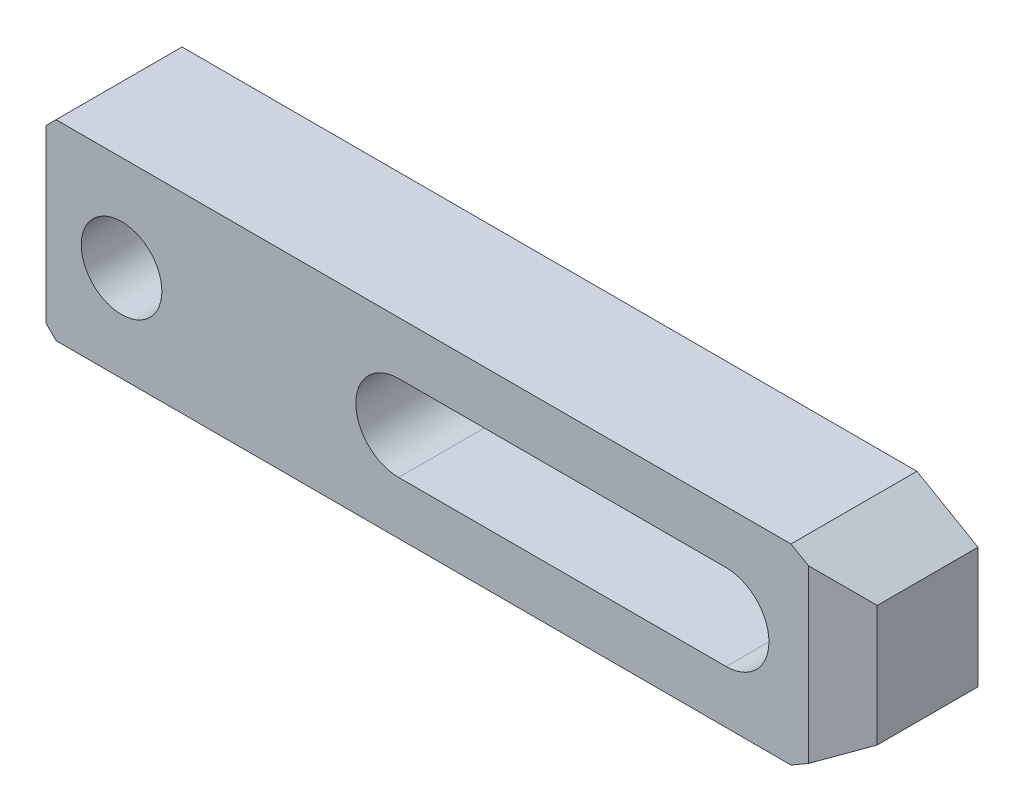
ISO-10303-21;
HEADER;
FILE_DESCRIPTION(('STEP AP214'),'2;1');
FILE_NAME('part.step','',(''),(''),'','','');
FILE_SCHEMA(('AUTOMOTIVE_DESIGN { 1 0 10303 214 1 1 1 1 }'));
ENDSEC;
DATA;
#1=APPLICATION_CONTEXT('core data for automotive mechanical design processes');
#2=APPLICATION_PROTOCOL_DEFINITION('international standard','automotive_design',2000,#1);
#3=PRODUCT_CONTEXT('',#1,'mechanical');
#4=PRODUCT('Part','Part','',(#3));
#5=PRODUCT_RELATED_PRODUCT_CATEGORY('part','',(#4));
#6=PRODUCT_DEFINITION_FORMATION('','',#4);
#7=PRODUCT_DEFINITION_CONTEXT('part definition',#1,'design');
#8=PRODUCT_DEFINITION('design','',#6,#7);
#9=PRODUCT_DEFINITION_SHAPE('','',#8);
#10=(LENGTH_UNIT() NAMED_UNIT(*) SI_UNIT(.MILLI.,.METRE.));
#11=(NAMED_UNIT(*) PLANE_ANGLE_UNIT() SI_UNIT($,.RADIAN.));
#12=(NAMED_UNIT(*) SI_UNIT($,.STERADIAN.) SOLID_ANGLE_UNIT());
#13=UNCERTAINTY_MEASURE_WITH_UNIT(LENGTH_MEASURE(1.E-05),#10,'distance_accuracy_value','');
#14=(GEOMETRIC_REPRESENTATION_CONTEXT(3) GLOBAL_UNCERTAINTY_ASSIGNED_CONTEXT((#13)) GLOBAL_UNIT_ASSIGNED_CONTEXT((#10,
#11,#12)) REPRESENTATION_CONTEXT('',''));
#15=CARTESIAN_POINT('',(0.,0.,0.));
#16=DIRECTION('',(0.,0.,1.));
#17=DIRECTION('',(1.,0.,0.));
#18=AXIS2_PLACEMENT_3D('',#15,#16,#17);
#19=CARTESIAN_POINT('',(-79.6058083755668,72.3941916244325,0.));
#20=DIRECTION('',(0.,0.,1.));
#21=DIRECTION('',(-1.,0.,0.));
#22=AXIS2_PLACEMENT_3D('',#19,#20,#21);
#23=PLANE('',#22);
#24=DIRECTION('',(0.,1.,0.));
#25=VECTOR('',#24,1.);
#26=CARTESIAN_POINT('',(-135.,-17.,0.));
#27=LINE('',#26,#25);
#28=CARTESIAN_POINT('',(-135.,-17.,0.));
#29=VERTEX_POINT('',#28);
#30=CARTESIAN_POINT('',(-135.,-8.5,0.));
#31=VERTEX_POINT('',#30);
#32=EDGE_CURVE('E147',#29,#31,#27,.T.);
#33=ORIENTED_EDGE('',*,*,#32,.T.);
#34=DIRECTION('',(-1.,0.,0.));
#35=VECTOR('',#34,1.);
#36=CARTESIAN_POINT('',(0.,-8.5,0.));
#37=LINE('',#36,#35);
#38=CARTESIAN_POINT('',(0.,-8.5,0.));
#39=VERTEX_POINT('',#38);
#40=EDGE_CURVE('E237',#39,#31,#37,.T.);
#41=ORIENTED_EDGE('',*,*,#40,.F.);
#42=CARTESIAN_POINT('',(0.,0.,0.));
#43=DIRECTION('',(0.,0.,1.));
#44=DIRECTION('',(-1.,0.,0.));
#45=AXIS2_PLACEMENT_3D('',#42,#43,#44);
#46=CIRCLE('',#45,8.5);
#47=CARTESIAN_POINT('',(0.,8.5,0.));
#48=VERTEX_POINT('',#47);
#49=EDGE_CURVE('E128',#39,#48,#46,.T.);
#50=ORIENTED_EDGE('',*,*,#49,.T.);
#51=DIRECTION('',(1.,0.,0.));
#52=VECTOR('',#51,1.);
#53=CARTESIAN_POINT('',(-65.,8.5,0.));
#54=LINE('',#53,#52);
#55=CARTESIAN_POINT('',(-135.,8.5,0.));
#56=VERTEX_POINT('',#55);
#57=EDGE_CURVE('E119',#56,#48,#54,.T.);
#58=ORIENTED_EDGE('',*,*,#57,.F.);
#59=CARTESIAN_POINT('',(-135.,17.,0.));
#60=VERTEX_POINT('',#59);
#61=EDGE_CURVE('E124',#56,#60,#27,.T.);
#62=ORIENTED_EDGE('',*,*,#61,.T.);
#63=DIRECTION('',(-0.707106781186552,-0.707106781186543,0.));
#64=VECTOR('',#63,1.);
#65=CARTESIAN_POINT('',(-133.,19.,0.));
#66=LINE('',#65,#64);
#67=CARTESIAN_POINT('',(-133.,19.,0.));
#68=VERTEX_POINT('',#67);
#69=EDGE_CURVE('E148',#68,#60,#66,.T.);
#70=ORIENTED_EDGE('',*,*,#69,.F.);
#71=DIRECTION('',(-1.,0.,0.));
#72=VECTOR('',#71,1.);
#73=CARTESIAN_POINT('',(12.875644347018,19.,0.));
#74=LINE('',#73,#72);
#75=CARTESIAN_POINT('',(12.875644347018,19.,0.));
#76=VERTEX_POINT('',#75);
#77=EDGE_CURVE('E151',#76,#68,#74,.T.);
#78=ORIENTED_EDGE('',*,*,#77,.F.);
#79=DIRECTION('',(-0.866025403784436,0.5,0.));
#80=VECTOR('',#79,1.);
#81=CARTESIAN_POINT('',(25.,12.,0.));
#82=LINE('',#81,#80);
#83=CARTESIAN_POINT('',(25.,12.,0.));
#84=VERTEX_POINT('',#83);
#85=EDGE_CURVE('E158',#84,#76,#82,.T.);
#86=ORIENTED_EDGE('',*,*,#85,.F.);
#87=DIRECTION('',(0.,-1.,0.));
#88=VECTOR('',#87,1.);
#89=CARTESIAN_POINT('',(25.,12.,0.));
#90=LINE('',#89,#88);
#91=CARTESIAN_POINT('',(25.,-12.,0.));
#92=VERTEX_POINT('',#91);
#93=EDGE_CURVE('E181',#84,#92,#90,.T.);
#94=ORIENTED_EDGE('',*,*,#93,.T.);
#95=DIRECTION('',(-0.86602540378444,-0.5,0.));
#96=VECTOR('',#95,1.);
#97=CARTESIAN_POINT('',(25.,-12.,0.));
#98=LINE('',#97,#96);
#99=CARTESIAN_POINT('',(12.8756443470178,-19.,0.));
#100=VERTEX_POINT('',#99);
#101=EDGE_CURVE('E208',#92,#100,#98,.T.);
#102=ORIENTED_EDGE('',*,*,#101,.T.);
#103=DIRECTION('',(-1.,0.,0.));
#104=VECTOR('',#103,1.);
#105=CARTESIAN_POINT('',(12.8756443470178,-19.,0.));
#106=LINE('',#105,#104);
#107=CARTESIAN_POINT('',(-133.,-19.,0.));
#108=VERTEX_POINT('',#107);
#109=EDGE_CURVE('E210',#100,#108,#106,.T.);
#110=ORIENTED_EDGE('',*,*,#109,.T.);
#111=DIRECTION('',(-0.707106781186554,0.707106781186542,0.));
#112=VECTOR('',#111,1.);
#113=CARTESIAN_POINT('',(-133.,-19.,0.));
#114=LINE('',#113,#112);
#115=EDGE_CURVE('E150',#108,#29,#114,.T.);
#116=ORIENTED_EDGE('',*,*,#115,.T.);
#117=EDGE_LOOP('',(#33,#41,#50,#58,#62,#70,#78,#86,#94,#102,#110,#116));
#118=FACE_BOUND('',#117,.T.);
#119=ADVANCED_FACE('F14',(#118),#23,.F.);
#120=CARTESIAN_POINT('',(-135.,-17.,25.));
#121=DIRECTION('',(-1.,0.,0.));
#122=DIRECTION('',(0.,0.,-1.));
#123=AXIS2_PLACEMENT_3D('',#120,#121,#122);
#124=PLANE('',#123);
#125=DIRECTION('',(0.,-1.,0.));
#126=VECTOR('',#125,1.);
#127=CARTESIAN_POINT('',(-135.,-17.,5.));
#128=LINE('',#127,#126);
#129=CARTESIAN_POINT('',(-135.,8.5,5.));
#130=VERTEX_POINT('',#129);
#131=CARTESIAN_POINT('',(-135.,-8.5,5.));
#132=VERTEX_POINT('',#131);
#133=EDGE_CURVE('E141',#130,#132,#128,.T.);
#134=ORIENTED_EDGE('',*,*,#133,.T.);
#135=DIRECTION('',(0.,0.,-1.));
#136=VECTOR('',#135,1.);
#137=CARTESIAN_POINT('',(-135.,-8.5,25.));
#138=LINE('',#137,#136);
#139=EDGE_CURVE('E140',#132,#31,#138,.T.);
#140=ORIENTED_EDGE('',*,*,#139,.T.);
#141=ORIENTED_EDGE('',*,*,#32,.F.);
#142=DIRECTION('',(0.,0.,-1.));
#143=VECTOR('',#142,1.);
#144=CARTESIAN_POINT('',(-135.,-17.,25.));
#145=LINE('',#144,#143);
#146=CARTESIAN_POINT('',(-135.,-17.,25.));
#147=VERTEX_POINT('',#146);
#148=EDGE_CURVE('E189',#147,#29,#145,.T.);
#149=ORIENTED_EDGE('',*,*,#148,.F.);
#150=DIRECTION('',(0.,1.,0.));
#151=VECTOR('',#150,1.);
#152=CARTESIAN_POINT('',(-135.,-17.,25.));
#153=LINE('',#152,#151);
#154=CARTESIAN_POINT('',(-135.,17.,25.));
#155=VERTEX_POINT('',#154);
#156=EDGE_CURVE('E171',#147,#155,#153,.T.);
#157=ORIENTED_EDGE('',*,*,#156,.T.);
#158=DIRECTION('',(0.,0.,-1.));
#159=VECTOR('',#158,1.);
#160=CARTESIAN_POINT('',(-135.,17.,25.));
#161=LINE('',#160,#159);
#162=EDGE_CURVE('E145',#155,#60,#161,.T.);
#163=ORIENTED_EDGE('',*,*,#162,.T.);
#164=ORIENTED_EDGE('',*,*,#61,.F.);
#165=DIRECTION('',(0.,0.,-1.));
#166=VECTOR('',#165,1.);
#167=CARTESIAN_POINT('',(-135.,8.5,25.));
#168=LINE('',#167,#166);
#169=EDGE_CURVE('E135',#130,#56,#168,.T.);
#170=ORIENTED_EDGE('',*,*,#169,.F.);
#171=EDGE_LOOP('',(#134,#140,#141,#149,#157,#163,#164,#170));
#172=FACE_BOUND('',#171,.T.);
#173=ADVANCED_FACE('F143',(#172),#124,.T.);
#174=CARTESIAN_POINT('',(-120.,0.,25.));
#175=DIRECTION('',(0.,0.,-1.));
#176=DIRECTION('',(1.,0.,0.));
#177=AXIS2_PLACEMENT_3D('',#174,#175,#176);
#178=CYLINDRICAL_SURFACE('',#177,8.);
#179=CARTESIAN_POINT('',(-120.,0.,25.));
#180=DIRECTION('',(0.,0.,1.));
#181=DIRECTION('',(-1.,0.,0.));
#182=AXIS2_PLACEMENT_3D('',#179,#180,#181);
#183=CIRCLE('',#182,8.);
#184=CARTESIAN_POINT('',(-128.,0.,25.));
#185=VERTEX_POINT('',#184);
#186=EDGE_CURVE('E161',#185,#185,#183,.T.);
#187=ORIENTED_EDGE('',*,*,#186,.T.);
#188=EDGE_LOOP('',(#187));
#189=FACE_BOUND('',#188,.T.);
#190=CARTESIAN_POINT('',(-120.,0.,5.));
#191=DIRECTION('',(0.,0.,-1.));
#192=DIRECTION('',(1.,0.,0.));
#193=AXIS2_PLACEMENT_3D('',#190,#191,#192);
#194=CIRCLE('',#193,8.);
#195=CARTESIAN_POINT('',(-112.,0.,5.));
#196=VERTEX_POINT('',#195);
#197=EDGE_CURVE('E398',#196,#196,#194,.T.);
#198=ORIENTED_EDGE('',*,*,#197,.T.);
#199=EDGE_LOOP('',(#198));
#200=FACE_BOUND('',#199,.T.);
#201=ADVANCED_FACE('F262',(#189,#200),#178,.F.);
#202=CARTESIAN_POINT('',(-65.,0.,25.));
#203=DIRECTION('',(0.,0.,-1.));
#204=DIRECTION('',(1.,0.,0.));
#205=AXIS2_PLACEMENT_3D('',#202,#203,#204);
#206=CYLINDRICAL_SURFACE('',#205,8.5);
#207=DIRECTION('',(0.,0.,-1.));
#208=VECTOR('',#207,1.);
#209=CARTESIAN_POINT('',(-65.,-8.5,25.));
#210=LINE('',#209,#208);
#211=CARTESIAN_POINT('',(-65.,-8.5,25.));
#212=VERTEX_POINT('',#211);
#213=CARTESIAN_POINT('',(-65.,-8.5,5.));
#214=VERTEX_POINT('',#213);
#215=EDGE_CURVE('E256',#212,#214,#210,.T.);
#216=ORIENTED_EDGE('',*,*,#215,.T.);
#217=CARTESIAN_POINT('',(-65.,0.,5.));
#218=DIRECTION('',(0.,0.,-1.));
#219=DIRECTION('',(1.,0.,0.));
#220=AXIS2_PLACEMENT_3D('',#217,#218,#219);
#221=CIRCLE('',#220,8.5);
#222=CARTESIAN_POINT('',(-65.,8.5,5.));
#223=VERTEX_POINT('',#222);
#224=EDGE_CURVE('E278',#214,#223,#221,.T.);
#225=ORIENTED_EDGE('',*,*,#224,.T.);
#226=DIRECTION('',(0.,0.,-1.));
#227=VECTOR('',#226,1.);
#228=CARTESIAN_POINT('',(-65.,8.5,25.));
#229=LINE('',#228,#227);
#230=CARTESIAN_POINT('',(-65.,8.5,25.));
#231=VERTEX_POINT('',#230);
#232=EDGE_CURVE('E244',#231,#223,#229,.T.);
#233=ORIENTED_EDGE('',*,*,#232,.F.);
#234=CARTESIAN_POINT('',(-65.,0.,25.));
#235=DIRECTION('',(0.,0.,1.));
#236=DIRECTION('',(-1.,0.,0.));
#237=AXIS2_PLACEMENT_3D('',#234,#235,#236);
#238=CIRCLE('',#237,8.5);
#239=EDGE_CURVE('E132',#231,#212,#238,.T.);
#240=ORIENTED_EDGE('',*,*,#239,.T.);
#241=EDGE_LOOP('',(#216,#225,#233,#240));
#242=FACE_BOUND('',#241,.T.);
#243=ADVANCED_FACE('F269',(#242),#206,.F.);
#244=CARTESIAN_POINT('',(-79.6058083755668,72.3941916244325,25.));
#245=DIRECTION('',(0.,0.,1.));
#246=DIRECTION('',(-1.,0.,0.));
#247=AXIS2_PLACEMENT_3D('',#244,#245,#246);
#248=PLANE('',#247);
#249=DIRECTION('',(0.,-1.,0.));
#250=VECTOR('',#249,1.);
#251=CARTESIAN_POINT('',(16.3397459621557,72.3941916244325,25.));
#252=LINE('',#251,#250);
#253=CARTESIAN_POINT('',(16.3397459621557,17.,25.));
#254=VERTEX_POINT('',#253);
#255=CARTESIAN_POINT('',(16.3397459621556,-17.,25.));
#256=VERTEX_POINT('',#255);
#257=EDGE_CURVE('E233',#254,#256,#252,.T.);
#258=ORIENTED_EDGE('',*,*,#257,.F.);
#259=DIRECTION('',(-0.866025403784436,0.5,0.));
#260=VECTOR('',#259,1.);
#261=CARTESIAN_POINT('',(25.,12.,25.));
#262=LINE('',#261,#260);
#263=CARTESIAN_POINT('',(12.875644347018,19.,25.));
#264=VERTEX_POINT('',#263);
#265=EDGE_CURVE('E179',#254,#264,#262,.T.);
#266=ORIENTED_EDGE('',*,*,#265,.T.);
#267=DIRECTION('',(-1.,0.,0.));
#268=VECTOR('',#267,1.);
#269=CARTESIAN_POINT('',(12.875644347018,19.,25.));
#270=LINE('',#269,#268);
#271=CARTESIAN_POINT('',(-133.,19.,25.));
#272=VERTEX_POINT('',#271);
#273=EDGE_CURVE('E176',#264,#272,#270,.T.);
#274=ORIENTED_EDGE('',*,*,#273,.T.);
#275=DIRECTION('',(-0.707106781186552,-0.707106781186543,0.));
#276=VECTOR('',#275,1.);
#277=CARTESIAN_POINT('',(-133.,19.,25.));
#278=LINE('',#277,#276);
#279=EDGE_CURVE('E173',#272,#155,#278,.T.);
#280=ORIENTED_EDGE('',*,*,#279,.T.);
#281=ORIENTED_EDGE('',*,*,#156,.F.);
#282=DIRECTION('',(-0.707106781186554,0.707106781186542,0.));
#283=VECTOR('',#282,1.);
#284=CARTESIAN_POINT('',(-133.,-19.,25.));
#285=LINE('',#284,#283);
#286=CARTESIAN_POINT('',(-133.,-19.,25.));
#287=VERTEX_POINT('',#286);
#288=EDGE_CURVE('E168',#287,#147,#285,.T.);
#289=ORIENTED_EDGE('',*,*,#288,.F.);
#290=DIRECTION('',(-1.,0.,0.));
#291=VECTOR('',#290,1.);
#292=CARTESIAN_POINT('',(12.8756443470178,-19.,25.));
#293=LINE('',#292,#291);
#294=CARTESIAN_POINT('',(12.8756443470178,-19.,25.));
#295=VERTEX_POINT('',#294);
#296=EDGE_CURVE('E165',#295,#287,#293,.T.);
#297=ORIENTED_EDGE('',*,*,#296,.F.);
#298=DIRECTION('',(-0.86602540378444,-0.5,0.));
#299=VECTOR('',#298,1.);
#300=CARTESIAN_POINT('',(25.,-12.,25.));
#301=LINE('',#300,#299);
#302=EDGE_CURVE('E162',#256,#295,#301,.T.);
#303=ORIENTED_EDGE('',*,*,#302,.F.);
#304=EDGE_LOOP('',(#258,#266,#274,#280,#281,#289,#297,#303));
#305=FACE_BOUND('',#304,.T.);
#306=ORIENTED_EDGE('',*,*,#186,.F.);
#307=EDGE_LOOP('',(#306));
#308=FACE_BOUND('',#307,.T.);
#309=DIRECTION('',(-1.,0.,0.));
#310=VECTOR('',#309,1.);
#311=CARTESIAN_POINT('',(0.,-8.5,25.));
#312=LINE('',#311,#310);
#313=CARTESIAN_POINT('',(0.,-8.5,25.));
#314=VERTEX_POINT('',#313);
#315=EDGE_CURVE('E247',#314,#212,#312,.T.);
#316=ORIENTED_EDGE('',*,*,#315,.T.);
#317=ORIENTED_EDGE('',*,*,#239,.F.);
#318=DIRECTION('',(1.,0.,0.));
#319=VECTOR('',#318,1.);
#320=CARTESIAN_POINT('',(-65.,8.5,25.));
#321=LINE('',#320,#319);
#322=CARTESIAN_POINT('',(0.,8.5,25.));
#323=VERTEX_POINT('',#322);
#324=EDGE_CURVE('E241',#231,#323,#321,.T.);
#325=ORIENTED_EDGE('',*,*,#324,.T.);
#326=CARTESIAN_POINT('',(0.,0.,25.));
#327=DIRECTION('',(0.,0.,1.));
#328=DIRECTION('',(-1.,0.,0.));
#329=AXIS2_PLACEMENT_3D('',#326,#327,#328);
#330=CIRCLE('',#329,8.5);
#331=EDGE_CURVE('E245',#314,#323,#330,.T.);
#332=ORIENTED_EDGE('',*,*,#331,.F.);
#333=EDGE_LOOP('',(#316,#317,#325,#332));
#334=FACE_BOUND('',#333,.T.);
#335=ADVANCED_FACE('F265',(#305,#308,#334),#248,.T.);
#336=CARTESIAN_POINT('',(25.,12.,25.));
#337=DIRECTION('',(-0.5,-0.866025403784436,0.));
#338=DIRECTION('',(0.866025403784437,-0.5,0.));
#339=AXIS2_PLACEMENT_3D('',#336,#337,#338);
#340=PLANE('',#339);
#341=ORIENTED_EDGE('',*,*,#265,.F.);
#342=DIRECTION('',(0.774596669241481,-0.447213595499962,-0.447213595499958));
#343=VECTOR('',#342,1.);
#344=CARTESIAN_POINT('',(23.2679491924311,13.,21.));
#345=LINE('',#344,#343);
#346=CARTESIAN_POINT('',(25.,12.,20.));
#347=VERTEX_POINT('',#346);
#348=EDGE_CURVE('E235',#254,#347,#345,.T.);
#349=ORIENTED_EDGE('',*,*,#348,.T.);
#350=DIRECTION('',(0.,0.,-1.));
#351=VECTOR('',#350,1.);
#352=CARTESIAN_POINT('',(25.,12.,25.));
#353=LINE('',#352,#351);
#354=EDGE_CURVE('E164',#347,#84,#353,.T.);
#355=ORIENTED_EDGE('',*,*,#354,.T.);
#356=ORIENTED_EDGE('',*,*,#85,.T.);
#357=DIRECTION('',(0.,0.,-1.));
#358=VECTOR('',#357,1.);
#359=CARTESIAN_POINT('',(12.875644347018,19.,25.));
#360=LINE('',#359,#358);
#361=EDGE_CURVE('E9',#264,#76,#360,.T.);
#362=ORIENTED_EDGE('',*,*,#361,.F.);
#363=EDGE_LOOP('',(#341,#349,#355,#356,#362));
#364=FACE_BOUND('',#363,.T.);
#365=ADVANCED_FACE('F268',(#364),#340,.F.);
#366=CARTESIAN_POINT('',(12.875644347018,19.,25.));
#367=DIRECTION('',(0.,-1.,0.));
#368=DIRECTION('',(0.,0.,1.));
#369=AXIS2_PLACEMENT_3D('',#366,#367,#368);
#370=PLANE('',#369);
#371=DIRECTION('',(0.,0.,-1.));
#372=VECTOR('',#371,1.);
#373=CARTESIAN_POINT('',(-133.,19.,25.));
#374=LINE('',#373,#372);
#375=EDGE_CURVE('E22',#272,#68,#374,.T.);
#376=ORIENTED_EDGE('',*,*,#375,.F.);
#377=ORIENTED_EDGE('',*,*,#273,.F.);
#378=ORIENTED_EDGE('',*,*,#361,.T.);
#379=ORIENTED_EDGE('',*,*,#77,.T.);
#380=EDGE_LOOP('',(#376,#377,#378,#379));
#381=FACE_BOUND('',#380,.T.);
#382=ADVANCED_FACE('F16',(#381),#370,.F.);
#383=CARTESIAN_POINT('',(-133.,19.,25.));
#384=DIRECTION('',(0.707106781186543,-0.707106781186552,0.));
#385=DIRECTION('',(0.707106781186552,0.707106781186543,0.));
#386=AXIS2_PLACEMENT_3D('',#383,#384,#385);
#387=PLANE('',#386);
#388=ORIENTED_EDGE('',*,*,#162,.F.);
#389=ORIENTED_EDGE('',*,*,#279,.F.);
#390=ORIENTED_EDGE('',*,*,#375,.T.);
#391=ORIENTED_EDGE('',*,*,#69,.T.);
#392=EDGE_LOOP('',(#388,#389,#390,#391));
#393=FACE_BOUND('',#392,.T.);
#394=ADVANCED_FACE('F193',(#393),#387,.F.);
#395=CARTESIAN_POINT('',(-133.,-19.,25.));
#396=DIRECTION('',(-0.707106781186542,-0.707106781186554,0.));
#397=DIRECTION('',(0.707106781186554,-0.707106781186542,0.));
#398=AXIS2_PLACEMENT_3D('',#395,#396,#397);
#399=PLANE('',#398);
#400=DIRECTION('',(0.,0.,-1.));
#401=VECTOR('',#400,1.);
#402=CARTESIAN_POINT('',(-133.,-19.,25.));
#403=LINE('',#402,#401);
#404=EDGE_CURVE('E187',#287,#108,#403,.T.);
#405=ORIENTED_EDGE('',*,*,#404,.F.);
#406=ORIENTED_EDGE('',*,*,#288,.T.);
#407=ORIENTED_EDGE('',*,*,#148,.T.);
#408=ORIENTED_EDGE('',*,*,#115,.F.);
#409=EDGE_LOOP('',(#405,#406,#407,#408));
#410=FACE_BOUND('',#409,.T.);
#411=ADVANCED_FACE('F220',(#410),#399,.T.);
#412=CARTESIAN_POINT('',(12.8756443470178,-19.,25.));
#413=DIRECTION('',(0.,-1.,0.));
#414=DIRECTION('',(0.,0.,1.));
#415=AXIS2_PLACEMENT_3D('',#412,#413,#414);
#416=PLANE('',#415);
#417=DIRECTION('',(0.,0.,-1.));
#418=VECTOR('',#417,1.);
#419=CARTESIAN_POINT('',(12.8756443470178,-19.,25.));
#420=LINE('',#419,#418);
#421=EDGE_CURVE('E185',#295,#100,#420,.T.);
#422=ORIENTED_EDGE('',*,*,#421,.F.);
#423=ORIENTED_EDGE('',*,*,#296,.T.);
#424=ORIENTED_EDGE('',*,*,#404,.T.);
#425=ORIENTED_EDGE('',*,*,#109,.F.);
#426=EDGE_LOOP('',(#422,#423,#424,#425));
#427=FACE_BOUND('',#426,.T.);
#428=ADVANCED_FACE('F306',(#427),#416,.T.);
#429=CARTESIAN_POINT('',(25.,-12.,25.));
#430=DIRECTION('',(0.5,-0.86602540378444,0.));
#431=DIRECTION('',(0.86602540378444,0.5,0.));
#432=AXIS2_PLACEMENT_3D('',#429,#430,#431);
#433=PLANE('',#432);
#434=DIRECTION('',(0.774596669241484,0.447213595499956,-0.44721359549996));
#435=VECTOR('',#434,1.);
#436=CARTESIAN_POINT('',(23.2679491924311,-13.,21.));
#437=LINE('',#436,#435);
#438=CARTESIAN_POINT('',(25.,-12.,20.));
#439=VERTEX_POINT('',#438);
#440=EDGE_CURVE('E37',#256,#439,#437,.T.);
#441=ORIENTED_EDGE('',*,*,#440,.F.);
#442=ORIENTED_EDGE('',*,*,#302,.T.);
#443=ORIENTED_EDGE('',*,*,#421,.T.);
#444=ORIENTED_EDGE('',*,*,#101,.F.);
#445=DIRECTION('',(0.,0.,-1.));
#446=VECTOR('',#445,1.);
#447=CARTESIAN_POINT('',(25.,-12.,25.));
#448=LINE('',#447,#446);
#449=EDGE_CURVE('E183',#439,#92,#448,.T.);
#450=ORIENTED_EDGE('',*,*,#449,.F.);
#451=EDGE_LOOP('',(#441,#442,#443,#444,#450));
#452=FACE_BOUND('',#451,.T.);
#453=ADVANCED_FACE('F303',(#452),#433,.T.);
#454=CARTESIAN_POINT('',(25.,12.,25.));
#455=DIRECTION('',(1.,0.,0.));
#456=DIRECTION('',(0.,0.,1.));
#457=AXIS2_PLACEMENT_3D('',#454,#455,#456);
#458=PLANE('',#457);
#459=DIRECTION('',(0.,-1.,0.));
#460=VECTOR('',#459,1.);
#461=CARTESIAN_POINT('',(25.,20.,20.));
#462=LINE('',#461,#460);
#463=EDGE_CURVE('E227',#347,#439,#462,.T.);
#464=ORIENTED_EDGE('',*,*,#463,.T.);
#465=ORIENTED_EDGE('',*,*,#449,.T.);
#466=ORIENTED_EDGE('',*,*,#93,.F.);
#467=ORIENTED_EDGE('',*,*,#354,.F.);
#468=EDGE_LOOP('',(#464,#465,#466,#467));
#469=FACE_BOUND('',#468,.T.);
#470=ADVANCED_FACE('F205',(#469),#458,.T.);
#471=CARTESIAN_POINT('',(0.,-8.5,25.));
#472=DIRECTION('',(0.,-1.,0.));
#473=DIRECTION('',(1.,0.,0.));
#474=AXIS2_PLACEMENT_3D('',#471,#472,#473);
#475=PLANE('',#474);
#476=ORIENTED_EDGE('',*,*,#40,.T.);
#477=ORIENTED_EDGE('',*,*,#139,.F.);
#478=DIRECTION('',(1.,0.,0.));
#479=VECTOR('',#478,1.);
#480=CARTESIAN_POINT('',(-145.,-8.5,5.));
#481=LINE('',#480,#479);
#482=EDGE_CURVE('E276',#132,#214,#481,.T.);
#483=ORIENTED_EDGE('',*,*,#482,.T.);
#484=ORIENTED_EDGE('',*,*,#215,.F.);
#485=ORIENTED_EDGE('',*,*,#315,.F.);
#486=DIRECTION('',(0.,0.,-1.));
#487=VECTOR('',#486,1.);
#488=CARTESIAN_POINT('',(0.,-8.5,25.));
#489=LINE('',#488,#487);
#490=EDGE_CURVE('E255',#314,#39,#489,.T.);
#491=ORIENTED_EDGE('',*,*,#490,.T.);
#492=EDGE_LOOP('',(#476,#477,#483,#484,#485,#491));
#493=FACE_BOUND('',#492,.T.);
#494=ADVANCED_FACE('F275',(#493),#475,.F.);
#495=CARTESIAN_POINT('',(0.,0.,25.));
#496=DIRECTION('',(0.,0.,-1.));
#497=DIRECTION('',(1.,0.,0.));
#498=AXIS2_PLACEMENT_3D('',#495,#496,#497);
#499=CYLINDRICAL_SURFACE('',#498,8.5);
#500=DIRECTION('',(0.,0.,-1.));
#501=VECTOR('',#500,1.);
#502=CARTESIAN_POINT('',(0.,8.5,25.));
#503=LINE('',#502,#501);
#504=EDGE_CURVE('E253',#323,#48,#503,.T.);
#505=ORIENTED_EDGE('',*,*,#504,.T.);
#506=ORIENTED_EDGE('',*,*,#49,.F.);
#507=ORIENTED_EDGE('',*,*,#490,.F.);
#508=ORIENTED_EDGE('',*,*,#331,.T.);
#509=EDGE_LOOP('',(#505,#506,#507,#508));
#510=FACE_BOUND('',#509,.T.);
#511=ADVANCED_FACE('F280',(#510),#499,.F.);
#512=CARTESIAN_POINT('',(-65.,8.5,25.));
#513=DIRECTION('',(0.,1.,0.));
#514=DIRECTION('',(0.,0.,-1.));
#515=AXIS2_PLACEMENT_3D('',#512,#513,#514);
#516=PLANE('',#515);
#517=ORIENTED_EDGE('',*,*,#57,.T.);
#518=ORIENTED_EDGE('',*,*,#504,.F.);
#519=ORIENTED_EDGE('',*,*,#324,.F.);
#520=ORIENTED_EDGE('',*,*,#232,.T.);
#521=DIRECTION('',(1.,0.,0.));
#522=VECTOR('',#521,1.);
#523=CARTESIAN_POINT('',(-145.,8.5,5.));
#524=LINE('',#523,#522);
#525=EDGE_CURVE('E29',#130,#223,#524,.T.);
#526=ORIENTED_EDGE('',*,*,#525,.F.);
#527=ORIENTED_EDGE('',*,*,#169,.T.);
#528=EDGE_LOOP('',(#517,#518,#519,#520,#526,#527));
#529=FACE_BOUND('',#528,.T.);
#530=ADVANCED_FACE('F136',(#529),#516,.F.);
#531=CARTESIAN_POINT('',(12.875644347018,20.,27.));
#532=DIRECTION('',(-0.5,0.,-0.866025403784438));
#533=DIRECTION('',(0.866025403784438,0.,-0.5));
#534=AXIS2_PLACEMENT_3D('',#531,#532,#533);
#535=PLANE('',#534);
#536=ORIENTED_EDGE('',*,*,#257,.T.);
#537=ORIENTED_EDGE('',*,*,#440,.T.);
#538=ORIENTED_EDGE('',*,*,#463,.F.);
#539=ORIENTED_EDGE('',*,*,#348,.F.);
#540=EDGE_LOOP('',(#536,#537,#538,#539));
#541=FACE_BOUND('',#540,.T.);
#542=ADVANCED_FACE('F288',(#541),#535,.F.);
#543=CARTESIAN_POINT('',(-145.,-8.5,5.));
#544=DIRECTION('',(0.,0.,-1.));
#545=DIRECTION('',(1.,0.,0.));
#546=AXIS2_PLACEMENT_3D('',#543,#544,#545);
#547=PLANE('',#546);
#548=ORIENTED_EDGE('',*,*,#197,.F.);
#549=EDGE_LOOP('',(#548));
#550=FACE_BOUND('',#549,.T.);
#551=ORIENTED_EDGE('',*,*,#525,.T.);
#552=ORIENTED_EDGE('',*,*,#224,.F.);
#553=ORIENTED_EDGE('',*,*,#482,.F.);
#554=ORIENTED_EDGE('',*,*,#133,.F.);
#555=EDGE_LOOP('',(#551,#552,#553,#554));
#556=FACE_BOUND('',#555,.T.);
#557=ADVANCED_FACE('F384',(#550,#556),#547,.T.);
#558=CLOSED_SHELL('',(#119,#173,#201,#243,#335,#365,#382,#394,#411,#428,#453,#470,#494,#511,
#530,#542,#557));
#559=MANIFOLD_SOLID_BREP('B1',#558);
#560=ADVANCED_BREP_SHAPE_REPRESENTATION('',(#18,#559),#14);
#561=SHAPE_DEFINITION_REPRESENTATION(#9,#560);
ENDSEC;
END-ISO-10303-21;
